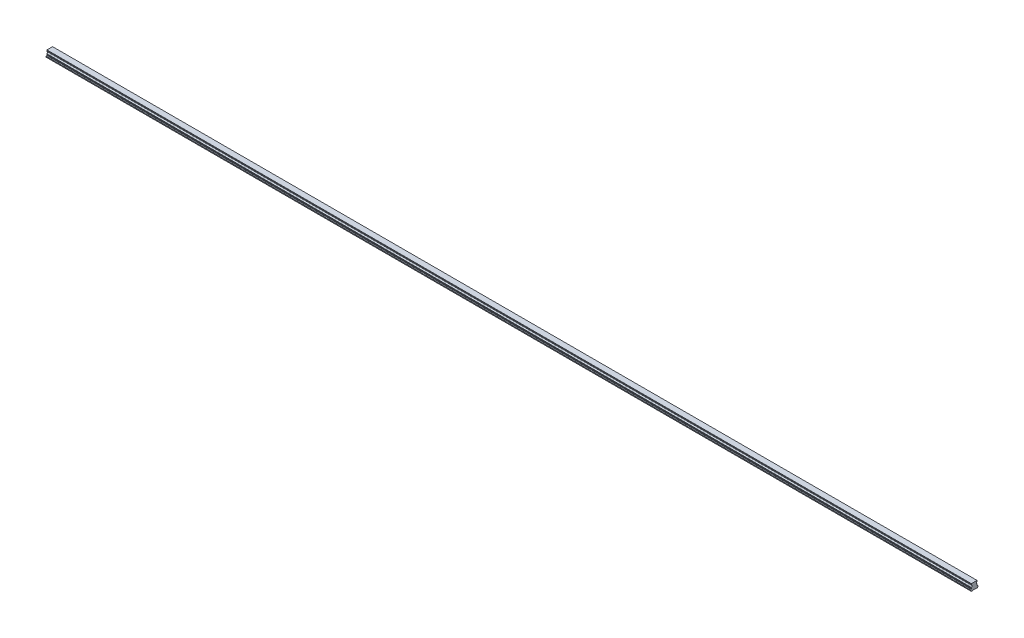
from build123d import *

# Parameters (mm, degrees)
BOSS_EXTRUDE1_DEPTH        = 3060
SKETCH3_R                  = 3
SKETCH3_R_2                = 2.5
CUT_EXTRUDE3_DEPTH         = 12
SKETCH3_2_R                = 2.5
CUT_EXTRUDE4_DEPTH         = 15
CHAMFER1_SIZE              = 0.5
LPATTERN4_COUNT            = 51
LPATTERN4_PITCH            = 60
CHAMFER1_OF_LPATTERN4_SIZE = 0.5


with BuildPart() as part:
    # Sketch1 → Boss-Extrude1 (new body)
    with BuildSketch(Plane(origin=(0, 0, 0), x_dir=(0, 0, -1), z_dir=(1, 0, 0))):
        with BuildLine():
            Line((9.375, 21.8), (-9.375, 21.8))
            Line((-9.375, 21.8), (-9.375, 20.756))
            Line((-9.375, 20.756), (-10, 19.415683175))
            Line((-10, 19.415683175), (-10, 17.685449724))
            ThreePointArc((-10, 17.685449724), (-7.2, 14.6), (-10, 11.514550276))
            Line((-10, 11.514550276), (-10, 9.784316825))
            Line((-10, 9.784316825), (-9.375, 8.444))
            Line((-9.375, 8.444), (-9.922688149, 6.4))
            Line((-9.922688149, 6.4), (-12.5, 5.489338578))
            Line((-12.5, 5.489338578), (-12.5, 2.65))
            Line((-12.5, 2.65), (-9.85, 0))
            Line((-9.85, 0), (-5.5, 0))
            Line((-5.5, 0), (-5, 0.5))
            Line((-5, 0.5), (5, 0.5))
            Line((5, 0.5), (5.5, 0))
            Line((5.5, 0), (9.85, 0))
            Line((9.85, 0), (12.5, 2.65))
            Line((12.5, 2.65), (12.5, 5.489338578))
            Line((12.5, 5.489338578), (9.922688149, 6.4))
            Line((9.922688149, 6.4), (9.375, 8.444))
            Line((9.375, 8.444), (10, 9.784316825))
            Line((10, 9.784316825), (10, 11.514550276))
            ThreePointArc((10, 11.514550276), (7.2, 14.6), (10, 17.685449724))
            Line((10, 17.685449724), (10, 19.415683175))
            Line((10, 19.415683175), (9.375, 20.756))
            Line((9.375, 20.756), (9.375, 21.8))
        make_face()
    extrude(amount=BOSS_EXTRUDE1_DEPTH)

    # Sketch3 → Cut-Extrude3 (cut)
    with BuildSketch(Plane.XZ):
        with Locations(Location((30, 0, 0), (0, 0, 270))):
            Circle(SKETCH3_R)
        with Locations(Location((30, 0, 0), (0, 0, 270))):
            Circle(SKETCH3_R_2, mode=Mode.SUBTRACT)
    cut_extrude3 = extrude(amount=-CUT_EXTRUDE3_DEPTH, mode=Mode.SUBTRACT)

    # Sketch3_2 → Cut-Extrude4 (cut)
    with BuildSketch(Plane.XZ):
        with Locations(Location((30, 0, 0), (0, 0, 270))):
            Circle(SKETCH3_2_R)
    cut_extrude4 = extrude(amount=-CUT_EXTRUDE4_DEPTH, mode=Mode.SUBTRACT)

    # Cut-Extrude5 cone 1 section (on through the dimple's axis) → Cut-Extrude5 (revolve, cut)
    with BuildSketch(Plane(origin=(30, 15, 0), x_dir=(0, 0, -1), z_dir=(1, 0, 0))):
        Polygon((0, 0), (2.5, 0), (0, 1.443375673), align=None)
    cut_extrude5 = revolve(axis=Axis((30, 15, 0), (0, 1, 0)), mode=Mode.SUBTRACT)

    # Chamfer1
    chamfer1_edges = [part.edges().sort_by_distance(p)[0] for p in [
        (30, 0.5, 3),
    ]]
    chamfer(chamfer1_edges, length=CHAMFER1_SIZE)

    # LPattern4: Cut-Extrude3, Cut-Extrude4, Cut-Extrude5 ×51
    with Locations(*[(i * LPATTERN4_PITCH, 0, 0) for i in range(1, LPATTERN4_COUNT)]):
        add(cut_extrude3, mode=Mode.SUBTRACT)
        add(cut_extrude4, mode=Mode.SUBTRACT)
        add(cut_extrude5, mode=Mode.SUBTRACT)

    # Chamfer1 of LPattern4
    chamfer1_of_lpattern4_edges = [part.edges().sort_by_distance(p)[0] for p in [
        (90, 0.5, 3),
        (150, 0.5, 3),
        (210, 0.5, 3),
        (270, 0.5, 3),
        (330, 0.5, 3),
        (390, 0.5, 3),
        (450, 0.5, 3),
        (510, 0.5, 3),
        (570, 0.5, 3),
        (630, 0.5, 3),
        (690, 0.5, 3),
        (750, 0.5, 3),
        (810, 0.5, 3),
        (870, 0.5, 3),
        (930, 0.5, 3),
        (990, 0.5, 3),
        (1050, 0.5, 3),
        (1110, 0.5, 3),
        (1170, 0.5, 3),
        (1230, 0.5, 3),
        (1290, 0.5, 3),
        (1350, 0.5, 3),
        (1410, 0.5, 3),
        (1470, 0.5, 3),
        (1530, 0.5, 3),
        (1590, 0.5, 3),
        (1650, 0.5, 3),
        (1710, 0.5, 3),
        (1770, 0.5, 3),
        (1830, 0.5, 3),
        (1890, 0.5, 3),
        (1950, 0.5, 3),
        (2010, 0.5, 3),
        (2070, 0.5, 3),
        (2130, 0.5, 3),
        (2190, 0.5, 3),
        (2250, 0.5, 3),
        (2310, 0.5, 3),
        (2370, 0.5, 3),
        (2430, 0.5, 3),
        (2490, 0.5, 3),
        (2550, 0.5, 3),
        (2610, 0.5, 3),
        (2670, 0.5, 3),
        (2730, 0.5, 3),
        (2790, 0.5, 3),
        (2850, 0.5, 3),
        (2910, 0.5, 3),
        (2970, 0.5, 3),
        (3030, 0.5, 3),
    ]]
    chamfer(chamfer1_of_lpattern4_edges, length=CHAMFER1_OF_LPATTERN4_SIZE)


solid = part.part
